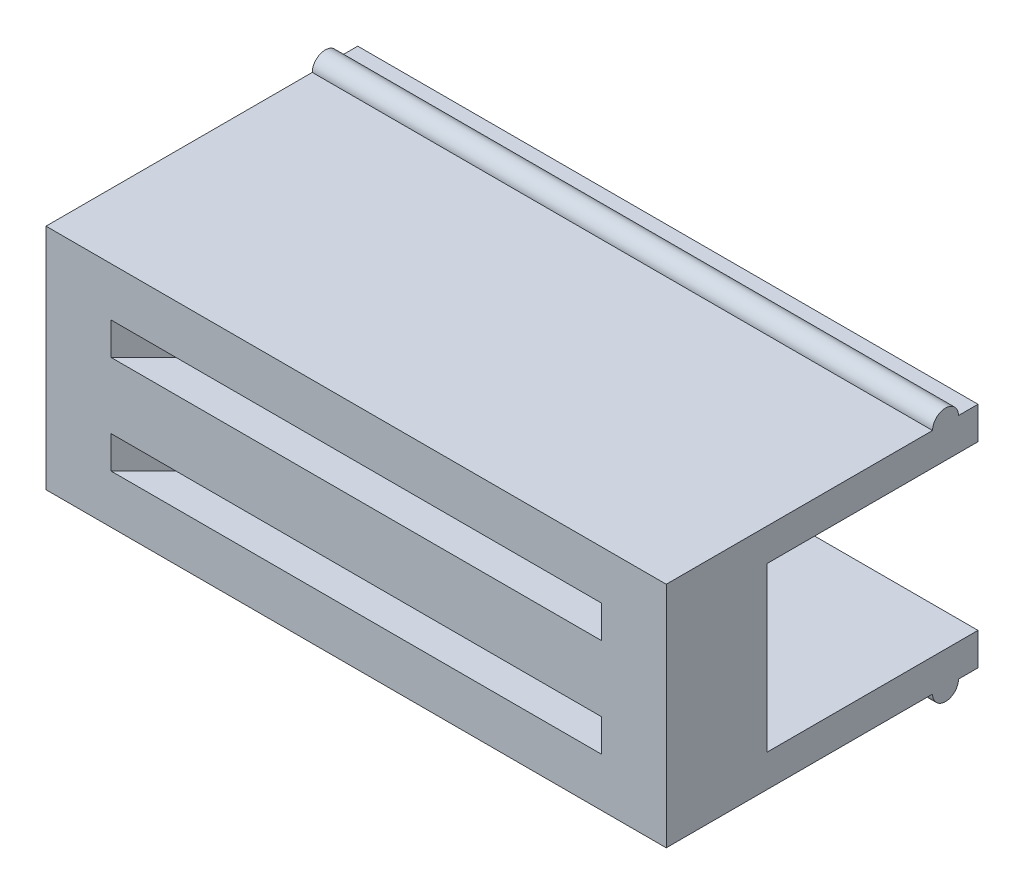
ISO-10303-21;
HEADER;
FILE_DESCRIPTION(('STEP AP214'),'2;1');
FILE_NAME('part.step','',(''),(''),'','','');
FILE_SCHEMA(('AUTOMOTIVE_DESIGN { 1 0 10303 214 1 1 1 1 }'));
ENDSEC;
DATA;
#1=APPLICATION_CONTEXT('core data for automotive mechanical design processes');
#2=APPLICATION_PROTOCOL_DEFINITION('international standard','automotive_design',2000,#1);
#3=PRODUCT_CONTEXT('',#1,'mechanical');
#4=PRODUCT('Part','Part','',(#3));
#5=PRODUCT_RELATED_PRODUCT_CATEGORY('part','',(#4));
#6=PRODUCT_DEFINITION_FORMATION('','',#4);
#7=PRODUCT_DEFINITION_CONTEXT('part definition',#1,'design');
#8=PRODUCT_DEFINITION('design','',#6,#7);
#9=PRODUCT_DEFINITION_SHAPE('','',#8);
#10=(LENGTH_UNIT() NAMED_UNIT(*) SI_UNIT(.MILLI.,.METRE.));
#11=(NAMED_UNIT(*) PLANE_ANGLE_UNIT() SI_UNIT($,.RADIAN.));
#12=(NAMED_UNIT(*) SI_UNIT($,.STERADIAN.) SOLID_ANGLE_UNIT());
#13=UNCERTAINTY_MEASURE_WITH_UNIT(LENGTH_MEASURE(1.E-05),#10,'distance_accuracy_value','');
#14=(GEOMETRIC_REPRESENTATION_CONTEXT(3) GLOBAL_UNCERTAINTY_ASSIGNED_CONTEXT((#13)) GLOBAL_UNIT_ASSIGNED_CONTEXT((#10,
#11,#12)) REPRESENTATION_CONTEXT('',''));
#15=CARTESIAN_POINT('',(0.,0.,0.));
#16=DIRECTION('',(0.,0.,1.));
#17=DIRECTION('',(1.,0.,0.));
#18=AXIS2_PLACEMENT_3D('',#15,#16,#17);
#19=CARTESIAN_POINT('',(-9.55,3.51500000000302,9.6));
#20=DIRECTION('',(0.,-1.,0.));
#21=DIRECTION('',(0.,0.,-1.));
#22=AXIS2_PLACEMENT_3D('',#19,#20,#21);
#23=PLANE('',#22);
#24=DIRECTION('',(0.,0.,-1.));
#25=VECTOR('',#24,1.);
#26=CARTESIAN_POINT('',(-9.55,3.51500000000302,9.6));
#27=LINE('',#26,#25);
#28=CARTESIAN_POINT('',(-9.55,3.51500000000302,0.599999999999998));
#29=VERTEX_POINT('',#28);
#30=CARTESIAN_POINT('',(-9.55,3.51500000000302,0.));
#31=VERTEX_POINT('',#30);
#32=EDGE_CURVE('E352',#29,#31,#27,.T.);
#33=ORIENTED_EDGE('',*,*,#32,.F.);
#34=DIRECTION('',(1.,0.,0.));
#35=VECTOR('',#34,1.);
#36=CARTESIAN_POINT('',(-9.55,3.51500000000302,0.599999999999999));
#37=LINE('',#36,#35);
#38=CARTESIAN_POINT('',(9.55,3.51500000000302,0.599999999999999));
#39=VERTEX_POINT('',#38);
#40=EDGE_CURVE('E231',#29,#39,#37,.T.);
#41=ORIENTED_EDGE('',*,*,#40,.T.);
#42=DIRECTION('',(0.,0.,-1.));
#43=VECTOR('',#42,1.);
#44=CARTESIAN_POINT('',(9.55,3.51500000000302,9.6));
#45=LINE('',#44,#43);
#46=CARTESIAN_POINT('',(9.55,3.51500000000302,0.));
#47=VERTEX_POINT('',#46);
#48=EDGE_CURVE('E373',#39,#47,#45,.T.);
#49=ORIENTED_EDGE('',*,*,#48,.T.);
#50=DIRECTION('',(-1.,0.,0.));
#51=VECTOR('',#50,1.);
#52=CARTESIAN_POINT('',(-9.55,3.51500000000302,0.));
#53=LINE('',#52,#51);
#54=EDGE_CURVE('E343',#47,#31,#53,.T.);
#55=ORIENTED_EDGE('',*,*,#54,.T.);
#56=EDGE_LOOP('',(#33,#41,#49,#55));
#57=FACE_BOUND('',#56,.T.);
#58=ADVANCED_FACE('F45',(#57),#23,.F.);
#59=CARTESIAN_POINT('',(-9.55,-3.51500000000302,9.6));
#60=DIRECTION('',(0.,1.,0.));
#61=DIRECTION('',(0.,0.,1.));
#62=AXIS2_PLACEMENT_3D('',#59,#60,#61);
#63=PLANE('',#62);
#64=DIRECTION('',(0.,0.,-1.));
#65=VECTOR('',#64,1.);
#66=CARTESIAN_POINT('',(-9.55,-3.51500000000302,9.6));
#67=LINE('',#66,#65);
#68=CARTESIAN_POINT('',(-9.55,-3.51500000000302,9.6));
#69=VERTEX_POINT('',#68);
#70=CARTESIAN_POINT('',(-9.55,-3.51500000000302,1.4));
#71=VERTEX_POINT('',#70);
#72=EDGE_CURVE('E383',#69,#71,#67,.T.);
#73=ORIENTED_EDGE('',*,*,#72,.T.);
#74=DIRECTION('',(1.,0.,0.));
#75=VECTOR('',#74,1.);
#76=CARTESIAN_POINT('',(-9.55,-3.51500000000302,1.4));
#77=LINE('',#76,#75);
#78=CARTESIAN_POINT('',(9.55,-3.51500000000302,1.4));
#79=VERTEX_POINT('',#78);
#80=EDGE_CURVE('E298',#71,#79,#77,.T.);
#81=ORIENTED_EDGE('',*,*,#80,.T.);
#82=DIRECTION('',(0.,0.,-1.));
#83=VECTOR('',#82,1.);
#84=CARTESIAN_POINT('',(9.55,-3.51500000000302,9.6));
#85=LINE('',#84,#83);
#86=CARTESIAN_POINT('',(9.55,-3.51500000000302,9.6));
#87=VERTEX_POINT('',#86);
#88=EDGE_CURVE('E378',#87,#79,#85,.T.);
#89=ORIENTED_EDGE('',*,*,#88,.F.);
#90=DIRECTION('',(1.,0.,0.));
#91=VECTOR('',#90,1.);
#92=CARTESIAN_POINT('',(-9.55,-3.51500000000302,9.6));
#93=LINE('',#92,#91);
#94=EDGE_CURVE('E342',#69,#87,#93,.T.);
#95=ORIENTED_EDGE('',*,*,#94,.F.);
#96=EDGE_LOOP('',(#73,#81,#89,#95));
#97=FACE_BOUND('',#96,.T.);
#98=ADVANCED_FACE('F435',(#97),#63,.F.);
#99=CARTESIAN_POINT('',(0.,0.,0.));
#100=DIRECTION('',(0.,0.,1.));
#101=DIRECTION('',(1.,0.,0.));
#102=AXIS2_PLACEMENT_3D('',#99,#100,#101);
#103=PLANE('',#102);
#104=DIRECTION('',(0.,-1.,0.));
#105=VECTOR('',#104,1.);
#106=CARTESIAN_POINT('',(-9.55,3.51500000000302,0.));
#107=LINE('',#106,#105);
#108=CARTESIAN_POINT('',(-9.55,-2.51500000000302,0.));
#109=VERTEX_POINT('',#108);
#110=CARTESIAN_POINT('',(-9.55,-3.51500000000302,0.));
#111=VERTEX_POINT('',#110);
#112=EDGE_CURVE('E328',#109,#111,#107,.T.);
#113=ORIENTED_EDGE('',*,*,#112,.F.);
#114=DIRECTION('',(-1.,0.,0.));
#115=VECTOR('',#114,1.);
#116=CARTESIAN_POINT('',(-9.55,-2.51500000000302,0.));
#117=LINE('',#116,#115);
#118=CARTESIAN_POINT('',(9.55,-2.51500000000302,0.));
#119=VERTEX_POINT('',#118);
#120=EDGE_CURVE('E308',#119,#109,#117,.T.);
#121=ORIENTED_EDGE('',*,*,#120,.F.);
#122=DIRECTION('',(0.,1.,0.));
#123=VECTOR('',#122,1.);
#124=CARTESIAN_POINT('',(9.55,3.51500000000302,0.));
#125=LINE('',#124,#123);
#126=CARTESIAN_POINT('',(9.55,-3.51500000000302,0.));
#127=VERTEX_POINT('',#126);
#128=EDGE_CURVE('E362',#127,#119,#125,.T.);
#129=ORIENTED_EDGE('',*,*,#128,.F.);
#130=DIRECTION('',(1.,0.,0.));
#131=VECTOR('',#130,1.);
#132=CARTESIAN_POINT('',(-9.55,-3.51500000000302,0.));
#133=LINE('',#132,#131);
#134=EDGE_CURVE('E357',#111,#127,#133,.T.);
#135=ORIENTED_EDGE('',*,*,#134,.F.);
#136=EDGE_LOOP('',(#113,#121,#129,#135));
#137=FACE_BOUND('',#136,.T.);
#138=ADVANCED_FACE('F440',(#137),#103,.F.);
#139=CARTESIAN_POINT('',(-9.55,3.51500000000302,9.6));
#140=DIRECTION('',(1.,0.,0.));
#141=DIRECTION('',(0.,0.,-1.));
#142=AXIS2_PLACEMENT_3D('',#139,#140,#141);
#143=PLANE('',#142);
#144=CARTESIAN_POINT('',(-9.55,3.51500000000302,9.6));
#145=VERTEX_POINT('',#144);
#146=CARTESIAN_POINT('',(-9.55,3.51500000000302,1.4));
#147=VERTEX_POINT('',#146);
#148=EDGE_CURVE('E369',#145,#147,#27,.T.);
#149=ORIENTED_EDGE('',*,*,#148,.T.);
#150=CARTESIAN_POINT('',(-9.55,3.51500000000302,0.999999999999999));
#151=DIRECTION('',(1.,0.,0.));
#152=DIRECTION('',(0.,0.,-1.));
#153=AXIS2_PLACEMENT_3D('',#150,#151,#152);
#154=CIRCLE('',#153,0.4);
#155=EDGE_CURVE('E285',#29,#147,#154,.T.);
#156=ORIENTED_EDGE('',*,*,#155,.F.);
#157=ORIENTED_EDGE('',*,*,#32,.T.);
#158=CARTESIAN_POINT('',(-9.55,2.51500000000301,0.));
#159=VERTEX_POINT('',#158);
#160=EDGE_CURVE('E353',#31,#159,#107,.T.);
#161=ORIENTED_EDGE('',*,*,#160,.T.);
#162=DIRECTION('',(0.,0.,-1.));
#163=VECTOR('',#162,1.);
#164=CARTESIAN_POINT('',(-9.55,2.51500000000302,6.5));
#165=LINE('',#164,#163);
#166=CARTESIAN_POINT('',(-9.55,2.51500000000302,6.5));
#167=VERTEX_POINT('',#166);
#168=EDGE_CURVE('E319',#167,#159,#165,.T.);
#169=ORIENTED_EDGE('',*,*,#168,.F.);
#170=DIRECTION('',(0.,1.,0.));
#171=VECTOR('',#170,1.);
#172=CARTESIAN_POINT('',(-9.55,-2.51500000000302,6.5));
#173=LINE('',#172,#171);
#174=CARTESIAN_POINT('',(-9.55,-2.51500000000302,6.5));
#175=VERTEX_POINT('',#174);
#176=EDGE_CURVE('E303',#175,#167,#173,.T.);
#177=ORIENTED_EDGE('',*,*,#176,.F.);
#178=DIRECTION('',(0.,0.,-1.));
#179=VECTOR('',#178,1.);
#180=CARTESIAN_POINT('',(-9.55,-2.51500000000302,6.5));
#181=LINE('',#180,#179);
#182=EDGE_CURVE('E324',#175,#109,#181,.T.);
#183=ORIENTED_EDGE('',*,*,#182,.T.);
#184=ORIENTED_EDGE('',*,*,#112,.T.);
#185=CARTESIAN_POINT('',(-9.55,-3.51500000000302,0.599999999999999));
#186=VERTEX_POINT('',#185);
#187=EDGE_CURVE('E382',#186,#111,#67,.T.);
#188=ORIENTED_EDGE('',*,*,#187,.F.);
#189=CARTESIAN_POINT('',(-9.55,-3.51500000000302,0.999999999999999));
#190=DIRECTION('',(1.,0.,0.));
#191=DIRECTION('',(0.,0.,-1.));
#192=AXIS2_PLACEMENT_3D('',#189,#190,#191);
#193=CIRCLE('',#192,0.4);
#194=EDGE_CURVE('E289',#71,#186,#193,.T.);
#195=ORIENTED_EDGE('',*,*,#194,.F.);
#196=ORIENTED_EDGE('',*,*,#72,.F.);
#197=DIRECTION('',(0.,-1.,0.));
#198=VECTOR('',#197,1.);
#199=CARTESIAN_POINT('',(-9.55,3.51500000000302,9.6));
#200=LINE('',#199,#198);
#201=EDGE_CURVE('E338',#145,#69,#200,.T.);
#202=ORIENTED_EDGE('',*,*,#201,.F.);
#203=EDGE_LOOP('',(#149,#156,#157,#161,#169,#177,#183,#184,#188,#195,#196,#202));
#204=FACE_BOUND('',#203,.T.);
#205=ADVANCED_FACE('F398',(#204),#143,.F.);
#206=CARTESIAN_POINT('',(9.55,-3.51500000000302,0.599999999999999));
#207=VERTEX_POINT('',#206);
#208=EDGE_CURVE('E377',#207,#127,#85,.T.);
#209=ORIENTED_EDGE('',*,*,#208,.F.);
#210=DIRECTION('',(1.,0.,0.));
#211=VECTOR('',#210,1.);
#212=CARTESIAN_POINT('',(-9.55,-3.51500000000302,0.599999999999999));
#213=LINE('',#212,#211);
#214=EDGE_CURVE('E292',#207,#186,#213,.F.);
#215=ORIENTED_EDGE('',*,*,#214,.T.);
#216=ORIENTED_EDGE('',*,*,#187,.T.);
#217=ORIENTED_EDGE('',*,*,#134,.T.);
#218=EDGE_LOOP('',(#209,#215,#216,#217));
#219=FACE_BOUND('',#218,.T.);
#220=ADVANCED_FACE('F443',(#219),#63,.F.);
#221=CARTESIAN_POINT('',(9.55,3.51500000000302,9.6));
#222=DIRECTION('',(-1.,0.,0.));
#223=DIRECTION('',(0.,0.,1.));
#224=AXIS2_PLACEMENT_3D('',#221,#222,#223);
#225=PLANE('',#224);
#226=ORIENTED_EDGE('',*,*,#48,.F.);
#227=CARTESIAN_POINT('',(9.55,3.51500000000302,0.999999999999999));
#228=DIRECTION('',(1.,0.,0.));
#229=DIRECTION('',(0.,0.,-1.));
#230=AXIS2_PLACEMENT_3D('',#227,#228,#229);
#231=CIRCLE('',#230,0.4);
#232=CARTESIAN_POINT('',(9.55,3.51500000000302,1.4));
#233=VERTEX_POINT('',#232);
#234=EDGE_CURVE('E280',#39,#233,#231,.T.);
#235=ORIENTED_EDGE('',*,*,#234,.T.);
#236=CARTESIAN_POINT('',(9.55,3.51500000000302,9.6));
#237=VERTEX_POINT('',#236);
#238=EDGE_CURVE('E374',#237,#233,#45,.T.);
#239=ORIENTED_EDGE('',*,*,#238,.F.);
#240=DIRECTION('',(0.,1.,0.));
#241=VECTOR('',#240,1.);
#242=CARTESIAN_POINT('',(9.55,3.51500000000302,9.6));
#243=LINE('',#242,#241);
#244=EDGE_CURVE('E346',#87,#237,#243,.T.);
#245=ORIENTED_EDGE('',*,*,#244,.F.);
#246=ORIENTED_EDGE('',*,*,#88,.T.);
#247=CARTESIAN_POINT('',(9.55,-3.51500000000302,0.999999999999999));
#248=DIRECTION('',(1.,0.,0.));
#249=DIRECTION('',(0.,0.,-1.));
#250=AXIS2_PLACEMENT_3D('',#247,#248,#249);
#251=CIRCLE('',#250,0.4);
#252=EDGE_CURVE('E284',#79,#207,#251,.T.);
#253=ORIENTED_EDGE('',*,*,#252,.T.);
#254=ORIENTED_EDGE('',*,*,#208,.T.);
#255=ORIENTED_EDGE('',*,*,#128,.T.);
#256=DIRECTION('',(0.,0.,-1.));
#257=VECTOR('',#256,1.);
#258=CARTESIAN_POINT('',(9.55,-2.51500000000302,6.5));
#259=LINE('',#258,#257);
#260=CARTESIAN_POINT('',(9.55,-2.51500000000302,6.5));
#261=VERTEX_POINT('',#260);
#262=EDGE_CURVE('E329',#261,#119,#259,.T.);
#263=ORIENTED_EDGE('',*,*,#262,.F.);
#264=DIRECTION('',(0.,-1.,0.));
#265=VECTOR('',#264,1.);
#266=CARTESIAN_POINT('',(9.55,-2.51500000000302,6.5));
#267=LINE('',#266,#265);
#268=CARTESIAN_POINT('',(9.55,2.51500000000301,6.5));
#269=VERTEX_POINT('',#268);
#270=EDGE_CURVE('E312',#269,#261,#267,.T.);
#271=ORIENTED_EDGE('',*,*,#270,.F.);
#272=DIRECTION('',(0.,0.,-1.));
#273=VECTOR('',#272,1.);
#274=CARTESIAN_POINT('',(9.55,2.51500000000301,6.5));
#275=LINE('',#274,#273);
#276=CARTESIAN_POINT('',(9.55,2.51500000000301,0.));
#277=VERTEX_POINT('',#276);
#278=EDGE_CURVE('E332',#269,#277,#275,.T.);
#279=ORIENTED_EDGE('',*,*,#278,.T.);
#280=EDGE_CURVE('E361',#277,#47,#125,.T.);
#281=ORIENTED_EDGE('',*,*,#280,.T.);
#282=EDGE_LOOP('',(#226,#235,#239,#245,#246,#253,#254,#255,#263,#271,#279,#281));
#283=FACE_BOUND('',#282,.T.);
#284=ADVANCED_FACE('F447',(#283),#225,.F.);
#285=ORIENTED_EDGE('',*,*,#238,.T.);
#286=DIRECTION('',(1.,0.,0.));
#287=VECTOR('',#286,1.);
#288=CARTESIAN_POINT('',(-9.55,3.51500000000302,1.4));
#289=LINE('',#288,#287);
#290=EDGE_CURVE('E238',#233,#147,#289,.F.);
#291=ORIENTED_EDGE('',*,*,#290,.T.);
#292=ORIENTED_EDGE('',*,*,#148,.F.);
#293=DIRECTION('',(-1.,0.,0.));
#294=VECTOR('',#293,1.);
#295=CARTESIAN_POINT('',(-9.55,3.51500000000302,9.6));
#296=LINE('',#295,#294);
#297=EDGE_CURVE('E349',#237,#145,#296,.T.);
#298=ORIENTED_EDGE('',*,*,#297,.F.);
#299=EDGE_LOOP('',(#285,#291,#292,#298));
#300=FACE_BOUND('',#299,.T.);
#301=ADVANCED_FACE('F390',(#300),#23,.F.);
#302=CARTESIAN_POINT('',(0.,0.,9.6));
#303=DIRECTION('',(0.,0.,1.));
#304=DIRECTION('',(1.,0.,0.));
#305=AXIS2_PLACEMENT_3D('',#302,#303,#304);
#306=PLANE('',#305);
#307=DIRECTION('',(0.,1.,0.));
#308=VECTOR('',#307,1.);
#309=CARTESIAN_POINT('',(7.55,-2.01500000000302,9.6));
#310=LINE('',#309,#308);
#311=CARTESIAN_POINT('',(7.55,-2.01500000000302,9.6));
#312=VERTEX_POINT('',#311);
#313=CARTESIAN_POINT('',(7.55,-1.01500000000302,9.6));
#314=VERTEX_POINT('',#313);
#315=EDGE_CURVE('E192',#312,#314,#310,.T.);
#316=ORIENTED_EDGE('',*,*,#315,.F.);
#317=DIRECTION('',(1.,0.,0.));
#318=VECTOR('',#317,1.);
#319=CARTESIAN_POINT('',(7.55,-2.01500000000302,9.6));
#320=LINE('',#319,#318);
#321=CARTESIAN_POINT('',(-7.55,-2.01500000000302,9.6));
#322=VERTEX_POINT('',#321);
#323=EDGE_CURVE('E198',#322,#312,#320,.T.);
#324=ORIENTED_EDGE('',*,*,#323,.F.);
#325=DIRECTION('',(0.,-1.,0.));
#326=VECTOR('',#325,1.);
#327=CARTESIAN_POINT('',(-7.55,-2.01500000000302,9.6));
#328=LINE('',#327,#326);
#329=CARTESIAN_POINT('',(-7.55,-1.01500000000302,9.6));
#330=VERTEX_POINT('',#329);
#331=EDGE_CURVE('E191',#330,#322,#328,.T.);
#332=ORIENTED_EDGE('',*,*,#331,.F.);
#333=DIRECTION('',(-1.,0.,0.));
#334=VECTOR('',#333,1.);
#335=CARTESIAN_POINT('',(7.55,-1.01500000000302,9.6));
#336=LINE('',#335,#334);
#337=EDGE_CURVE('E182',#314,#330,#336,.T.);
#338=ORIENTED_EDGE('',*,*,#337,.F.);
#339=EDGE_LOOP('',(#316,#324,#332,#338));
#340=FACE_BOUND('',#339,.T.);
#341=DIRECTION('',(0.,-1.,0.));
#342=VECTOR('',#341,1.);
#343=CARTESIAN_POINT('',(-7.55,2.01500000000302,9.6));
#344=LINE('',#343,#342);
#345=CARTESIAN_POINT('',(-7.55,2.01500000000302,9.6));
#346=VERTEX_POINT('',#345);
#347=CARTESIAN_POINT('',(-7.55,1.01500000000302,9.6));
#348=VERTEX_POINT('',#347);
#349=EDGE_CURVE('E265',#346,#348,#344,.T.);
#350=ORIENTED_EDGE('',*,*,#349,.F.);
#351=DIRECTION('',(-1.,0.,0.));
#352=VECTOR('',#351,1.);
#353=CARTESIAN_POINT('',(-7.55,2.01500000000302,9.6));
#354=LINE('',#353,#352);
#355=CARTESIAN_POINT('',(7.55,2.01500000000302,9.6));
#356=VERTEX_POINT('',#355);
#357=EDGE_CURVE('E279',#356,#346,#354,.T.);
#358=ORIENTED_EDGE('',*,*,#357,.F.);
#359=DIRECTION('',(0.,1.,0.));
#360=VECTOR('',#359,1.);
#361=CARTESIAN_POINT('',(7.55,2.01500000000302,9.6));
#362=LINE('',#361,#360);
#363=CARTESIAN_POINT('',(7.55,1.01500000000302,9.6));
#364=VERTEX_POINT('',#363);
#365=EDGE_CURVE('E273',#364,#356,#362,.T.);
#366=ORIENTED_EDGE('',*,*,#365,.F.);
#367=DIRECTION('',(1.,0.,0.));
#368=VECTOR('',#367,1.);
#369=CARTESIAN_POINT('',(-7.55,1.01500000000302,9.6));
#370=LINE('',#369,#368);
#371=EDGE_CURVE('E268',#348,#364,#370,.T.);
#372=ORIENTED_EDGE('',*,*,#371,.F.);
#373=EDGE_LOOP('',(#350,#358,#366,#372));
#374=FACE_BOUND('',#373,.T.);
#375=ORIENTED_EDGE('',*,*,#201,.T.);
#376=ORIENTED_EDGE('',*,*,#94,.T.);
#377=ORIENTED_EDGE('',*,*,#244,.T.);
#378=ORIENTED_EDGE('',*,*,#297,.T.);
#379=EDGE_LOOP('',(#375,#376,#377,#378));
#380=FACE_BOUND('',#379,.T.);
#381=ADVANCED_FACE('F196',(#340,#374,#380),#306,.T.);
#382=ORIENTED_EDGE('',*,*,#280,.F.);
#383=DIRECTION('',(1.,0.,0.));
#384=VECTOR('',#383,1.);
#385=CARTESIAN_POINT('',(-9.55,2.51500000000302,0.));
#386=LINE('',#385,#384);
#387=EDGE_CURVE('E302',#159,#277,#386,.T.);
#388=ORIENTED_EDGE('',*,*,#387,.F.);
#389=ORIENTED_EDGE('',*,*,#160,.F.);
#390=ORIENTED_EDGE('',*,*,#54,.F.);
#391=EDGE_LOOP('',(#382,#388,#389,#390));
#392=FACE_BOUND('',#391,.T.);
#393=ADVANCED_FACE('F452',(#392),#103,.F.);
#394=CARTESIAN_POINT('',(-9.55,-2.51500000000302,6.5));
#395=DIRECTION('',(0.,-1.,0.));
#396=DIRECTION('',(1.,0.,0.));
#397=AXIS2_PLACEMENT_3D('',#394,#395,#396);
#398=PLANE('',#397);
#399=ORIENTED_EDGE('',*,*,#120,.T.);
#400=ORIENTED_EDGE('',*,*,#182,.F.);
#401=DIRECTION('',(-1.,0.,0.));
#402=VECTOR('',#401,1.);
#403=CARTESIAN_POINT('',(-9.55,-2.51500000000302,6.5));
#404=LINE('',#403,#402);
#405=EDGE_CURVE('E315',#261,#175,#404,.T.);
#406=ORIENTED_EDGE('',*,*,#405,.F.);
#407=ORIENTED_EDGE('',*,*,#262,.T.);
#408=EDGE_LOOP('',(#399,#400,#406,#407));
#409=FACE_BOUND('',#408,.T.);
#410=ADVANCED_FACE('F583',(#409),#398,.F.);
#411=CARTESIAN_POINT('',(-9.55,2.51500000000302,6.5));
#412=DIRECTION('',(0.,1.,0.));
#413=DIRECTION('',(-1.,0.,0.));
#414=AXIS2_PLACEMENT_3D('',#411,#412,#413);
#415=PLANE('',#414);
#416=ORIENTED_EDGE('',*,*,#387,.T.);
#417=ORIENTED_EDGE('',*,*,#278,.F.);
#418=DIRECTION('',(1.,0.,0.));
#419=VECTOR('',#418,1.);
#420=CARTESIAN_POINT('',(-9.55,2.51500000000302,6.5));
#421=LINE('',#420,#419);
#422=EDGE_CURVE('E307',#167,#269,#421,.T.);
#423=ORIENTED_EDGE('',*,*,#422,.F.);
#424=ORIENTED_EDGE('',*,*,#168,.T.);
#425=EDGE_LOOP('',(#416,#417,#423,#424));
#426=FACE_BOUND('',#425,.T.);
#427=ADVANCED_FACE('F574',(#426),#415,.F.);
#428=CARTESIAN_POINT('',(0.,0.,6.5));
#429=DIRECTION('',(0.,0.,-1.));
#430=DIRECTION('',(-1.,0.,0.));
#431=AXIS2_PLACEMENT_3D('',#428,#429,#430);
#432=PLANE('',#431);
#433=ORIENTED_EDGE('',*,*,#176,.T.);
#434=ORIENTED_EDGE('',*,*,#422,.T.);
#435=ORIENTED_EDGE('',*,*,#270,.T.);
#436=ORIENTED_EDGE('',*,*,#405,.T.);
#437=EDGE_LOOP('',(#433,#434,#435,#436));
#438=FACE_BOUND('',#437,.T.);
#439=ADVANCED_FACE('F547',(#438),#432,.T.);
#440=CARTESIAN_POINT('',(-9.55,-3.51500000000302,0.999999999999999));
#441=DIRECTION('',(1.,0.,0.));
#442=DIRECTION('',(0.,0.,-1.));
#443=AXIS2_PLACEMENT_3D('',#440,#441,#442);
#444=CYLINDRICAL_SURFACE('',#443,0.4);
#445=ORIENTED_EDGE('',*,*,#80,.F.);
#446=ORIENTED_EDGE('',*,*,#194,.T.);
#447=ORIENTED_EDGE('',*,*,#214,.F.);
#448=ORIENTED_EDGE('',*,*,#252,.F.);
#449=EDGE_LOOP('',(#445,#446,#447,#448));
#450=FACE_BOUND('',#449,.T.);
#451=ADVANCED_FACE('F432',(#450),#444,.T.);
#452=CARTESIAN_POINT('',(-9.55,3.51500000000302,0.999999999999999));
#453=DIRECTION('',(1.,0.,0.));
#454=DIRECTION('',(0.,0.,-1.));
#455=AXIS2_PLACEMENT_3D('',#452,#453,#454);
#456=CYLINDRICAL_SURFACE('',#455,0.4);
#457=ORIENTED_EDGE('',*,*,#40,.F.);
#458=ORIENTED_EDGE('',*,*,#155,.T.);
#459=ORIENTED_EDGE('',*,*,#290,.F.);
#460=ORIENTED_EDGE('',*,*,#234,.F.);
#461=EDGE_LOOP('',(#457,#458,#459,#460));
#462=FACE_BOUND('',#461,.T.);
#463=ADVANCED_FACE('F401',(#462),#456,.T.);
#464=CARTESIAN_POINT('',(-7.55,2.01500000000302,7.6));
#465=DIRECTION('',(0.,1.,0.));
#466=DIRECTION('',(0.,0.,1.));
#467=AXIS2_PLACEMENT_3D('',#464,#465,#466);
#468=PLANE('',#467);
#469=DIRECTION('',(-1.,0.,0.));
#470=VECTOR('',#469,1.);
#471=CARTESIAN_POINT('',(-7.55,2.01500000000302,7.6));
#472=LINE('',#471,#470);
#473=CARTESIAN_POINT('',(5.54999999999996,2.01500000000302,7.6));
#474=VERTEX_POINT('',#473);
#475=CARTESIAN_POINT('',(-5.54999999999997,2.01500000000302,7.6));
#476=VERTEX_POINT('',#475);
#477=EDGE_CURVE('E228',#474,#476,#472,.T.);
#478=ORIENTED_EDGE('',*,*,#477,.F.);
#479=DIRECTION('',(0.707106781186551,0.,0.707106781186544));
#480=VECTOR('',#479,1.);
#481=CARTESIAN_POINT('',(5.54999999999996,2.01500000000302,7.6));
#482=LINE('',#481,#480);
#483=EDGE_CURVE('E244',#474,#356,#482,.T.);
#484=ORIENTED_EDGE('',*,*,#483,.T.);
#485=ORIENTED_EDGE('',*,*,#357,.T.);
#486=DIRECTION('',(0.707106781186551,0.,-0.707106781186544));
#487=VECTOR('',#486,1.);
#488=CARTESIAN_POINT('',(-5.54999999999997,2.01500000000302,7.6));
#489=LINE('',#488,#487);
#490=EDGE_CURVE('E235',#346,#476,#489,.T.);
#491=ORIENTED_EDGE('',*,*,#490,.T.);
#492=EDGE_LOOP('',(#478,#484,#485,#491));
#493=FACE_BOUND('',#492,.T.);
#494=ADVANCED_FACE('F424',(#493),#468,.F.);
#495=CARTESIAN_POINT('',(-7.55,1.01500000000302,7.6));
#496=DIRECTION('',(0.,-1.,0.));
#497=DIRECTION('',(0.,0.,-1.));
#498=AXIS2_PLACEMENT_3D('',#495,#496,#497);
#499=PLANE('',#498);
#500=ORIENTED_EDGE('',*,*,#371,.T.);
#501=DIRECTION('',(-0.707106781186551,0.,-0.707106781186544));
#502=VECTOR('',#501,1.);
#503=CARTESIAN_POINT('',(5.54999999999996,1.01500000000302,7.6));
#504=LINE('',#503,#502);
#505=CARTESIAN_POINT('',(6.54999999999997,1.01500000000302,8.6));
#506=VERTEX_POINT('',#505);
#507=EDGE_CURVE('E250',#364,#506,#504,.T.);
#508=ORIENTED_EDGE('',*,*,#507,.T.);
#509=DIRECTION('',(-1.,0.,0.));
#510=VECTOR('',#509,1.);
#511=CARTESIAN_POINT('',(-7.55,1.01500000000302,8.6));
#512=LINE('',#511,#510);
#513=CARTESIAN_POINT('',(-6.54999999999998,1.01500000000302,8.6));
#514=VERTEX_POINT('',#513);
#515=EDGE_CURVE('E255',#506,#514,#512,.T.);
#516=ORIENTED_EDGE('',*,*,#515,.T.);
#517=DIRECTION('',(-0.707106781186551,0.,0.707106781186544));
#518=VECTOR('',#517,1.);
#519=CARTESIAN_POINT('',(-5.54999999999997,1.01500000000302,7.6));
#520=LINE('',#519,#518);
#521=EDGE_CURVE('E247',#514,#348,#520,.T.);
#522=ORIENTED_EDGE('',*,*,#521,.T.);
#523=EDGE_LOOP('',(#500,#508,#516,#522));
#524=FACE_BOUND('',#523,.T.);
#525=ADVANCED_FACE('F258',(#524),#499,.F.);
#526=CARTESIAN_POINT('',(7.55,-2.01500000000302,7.6));
#527=DIRECTION('',(0.,-1.,0.));
#528=DIRECTION('',(1.,0.,0.));
#529=AXIS2_PLACEMENT_3D('',#526,#527,#528);
#530=PLANE('',#529);
#531=ORIENTED_EDGE('',*,*,#323,.T.);
#532=DIRECTION('',(-0.707106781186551,0.,-0.707106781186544));
#533=VECTOR('',#532,1.);
#534=CARTESIAN_POINT('',(5.54999999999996,-2.01500000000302,7.6));
#535=LINE('',#534,#533);
#536=CARTESIAN_POINT('',(5.54999999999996,-2.01500000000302,7.6));
#537=VERTEX_POINT('',#536);
#538=EDGE_CURVE('E11',#312,#537,#535,.T.);
#539=ORIENTED_EDGE('',*,*,#538,.T.);
#540=DIRECTION('',(1.,0.,0.));
#541=VECTOR('',#540,1.);
#542=CARTESIAN_POINT('',(7.55,-2.01500000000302,7.6));
#543=LINE('',#542,#541);
#544=CARTESIAN_POINT('',(-5.54999999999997,-2.01500000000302,7.6));
#545=VERTEX_POINT('',#544);
#546=EDGE_CURVE('E217',#545,#537,#543,.T.);
#547=ORIENTED_EDGE('',*,*,#546,.F.);
#548=DIRECTION('',(-0.707106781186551,0.,0.707106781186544));
#549=VECTOR('',#548,1.);
#550=CARTESIAN_POINT('',(-5.54999999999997,-2.01500000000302,7.6));
#551=LINE('',#550,#549);
#552=EDGE_CURVE('E55',#545,#322,#551,.T.);
#553=ORIENTED_EDGE('',*,*,#552,.T.);
#554=EDGE_LOOP('',(#531,#539,#547,#553));
#555=FACE_BOUND('',#554,.T.);
#556=ADVANCED_FACE('F215',(#555),#530,.F.);
#557=CARTESIAN_POINT('',(7.55,-1.01500000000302,7.6));
#558=DIRECTION('',(0.,1.,0.));
#559=DIRECTION('',(-1.,0.,0.));
#560=AXIS2_PLACEMENT_3D('',#557,#558,#559);
#561=PLANE('',#560);
#562=DIRECTION('',(-1.,0.,0.));
#563=VECTOR('',#562,1.);
#564=CARTESIAN_POINT('',(-7.55,-1.01500000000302,8.6));
#565=LINE('',#564,#563);
#566=CARTESIAN_POINT('',(6.54999999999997,-1.01500000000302,8.6));
#567=VERTEX_POINT('',#566);
#568=CARTESIAN_POINT('',(-6.54999999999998,-1.01500000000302,8.6));
#569=VERTEX_POINT('',#568);
#570=EDGE_CURVE('E256',#567,#569,#565,.T.);
#571=ORIENTED_EDGE('',*,*,#570,.F.);
#572=DIRECTION('',(0.707106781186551,0.,0.707106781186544));
#573=VECTOR('',#572,1.);
#574=CARTESIAN_POINT('',(5.54999999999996,-1.01500000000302,7.6));
#575=LINE('',#574,#573);
#576=EDGE_CURVE('E186',#567,#314,#575,.T.);
#577=ORIENTED_EDGE('',*,*,#576,.T.);
#578=ORIENTED_EDGE('',*,*,#337,.T.);
#579=DIRECTION('',(0.707106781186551,0.,-0.707106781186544));
#580=VECTOR('',#579,1.);
#581=CARTESIAN_POINT('',(-5.54999999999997,-1.01500000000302,7.6));
#582=LINE('',#581,#580);
#583=EDGE_CURVE('E62',#330,#569,#582,.T.);
#584=ORIENTED_EDGE('',*,*,#583,.T.);
#585=EDGE_LOOP('',(#571,#577,#578,#584));
#586=FACE_BOUND('',#585,.T.);
#587=ADVANCED_FACE('F184',(#586),#561,.F.);
#588=CARTESIAN_POINT('',(0.,0.,7.6));
#589=DIRECTION('',(0.,0.,1.));
#590=DIRECTION('',(1.,0.,0.));
#591=AXIS2_PLACEMENT_3D('',#588,#589,#590);
#592=PLANE('',#591);
#593=ORIENTED_EDGE('',*,*,#546,.T.);
#594=DIRECTION('',(0.,1.,0.));
#595=VECTOR('',#594,1.);
#596=CARTESIAN_POINT('',(5.54999999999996,0.,7.6));
#597=LINE('',#596,#595);
#598=EDGE_CURVE('E230',#537,#474,#597,.T.);
#599=ORIENTED_EDGE('',*,*,#598,.T.);
#600=ORIENTED_EDGE('',*,*,#477,.T.);
#601=DIRECTION('',(0.,-1.,0.));
#602=VECTOR('',#601,1.);
#603=CARTESIAN_POINT('',(-5.54999999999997,0.,7.6));
#604=LINE('',#603,#602);
#605=EDGE_CURVE('E221',#476,#545,#604,.T.);
#606=ORIENTED_EDGE('',*,*,#605,.T.);
#607=EDGE_LOOP('',(#593,#599,#600,#606));
#608=FACE_BOUND('',#607,.T.);
#609=ADVANCED_FACE('F224',(#608),#592,.T.);
#610=CARTESIAN_POINT('',(-7.55,1.18499999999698,8.6));
#611=DIRECTION('',(0.,0.,1.));
#612=DIRECTION('',(1.,0.,0.));
#613=AXIS2_PLACEMENT_3D('',#610,#611,#612);
#614=PLANE('',#613);
#615=ORIENTED_EDGE('',*,*,#515,.F.);
#616=DIRECTION('',(0.,-1.,0.));
#617=VECTOR('',#616,1.);
#618=CARTESIAN_POINT('',(6.54999999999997,0.,8.6));
#619=LINE('',#618,#617);
#620=EDGE_CURVE('E69',#506,#567,#619,.T.);
#621=ORIENTED_EDGE('',*,*,#620,.T.);
#622=ORIENTED_EDGE('',*,*,#570,.T.);
#623=DIRECTION('',(0.,1.,0.));
#624=VECTOR('',#623,1.);
#625=CARTESIAN_POINT('',(-6.54999999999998,0.,8.6));
#626=LINE('',#625,#624);
#627=EDGE_CURVE('E204',#569,#514,#626,.T.);
#628=ORIENTED_EDGE('',*,*,#627,.T.);
#629=EDGE_LOOP('',(#615,#621,#622,#628));
#630=FACE_BOUND('',#629,.T.);
#631=ADVANCED_FACE('F254',(#630),#614,.F.);
#632=CARTESIAN_POINT('',(5.54999999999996,0.,7.6));
#633=DIRECTION('',(0.707106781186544,0.,-0.707106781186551));
#634=DIRECTION('',(0.,1.,0.));
#635=AXIS2_PLACEMENT_3D('',#632,#633,#634);
#636=PLANE('',#635);
#637=ORIENTED_EDGE('',*,*,#507,.F.);
#638=ORIENTED_EDGE('',*,*,#365,.T.);
#639=ORIENTED_EDGE('',*,*,#483,.F.);
#640=ORIENTED_EDGE('',*,*,#598,.F.);
#641=ORIENTED_EDGE('',*,*,#538,.F.);
#642=ORIENTED_EDGE('',*,*,#315,.T.);
#643=ORIENTED_EDGE('',*,*,#576,.F.);
#644=ORIENTED_EDGE('',*,*,#620,.F.);
#645=EDGE_LOOP('',(#637,#638,#639,#640,#641,#642,#643,#644));
#646=FACE_BOUND('',#645,.T.);
#647=ADVANCED_FACE('F421',(#646),#636,.F.);
#648=CARTESIAN_POINT('',(-5.54999999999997,0.,7.6));
#649=DIRECTION('',(-0.707106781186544,0.,-0.707106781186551));
#650=DIRECTION('',(0.,-1.,0.));
#651=AXIS2_PLACEMENT_3D('',#648,#649,#650);
#652=PLANE('',#651);
#653=ORIENTED_EDGE('',*,*,#583,.F.);
#654=ORIENTED_EDGE('',*,*,#331,.T.);
#655=ORIENTED_EDGE('',*,*,#552,.F.);
#656=ORIENTED_EDGE('',*,*,#605,.F.);
#657=ORIENTED_EDGE('',*,*,#490,.F.);
#658=ORIENTED_EDGE('',*,*,#349,.T.);
#659=ORIENTED_EDGE('',*,*,#521,.F.);
#660=ORIENTED_EDGE('',*,*,#627,.F.);
#661=EDGE_LOOP('',(#653,#654,#655,#656,#657,#658,#659,#660));
#662=FACE_BOUND('',#661,.T.);
#663=ADVANCED_FACE('F48',(#662),#652,.F.);
#664=CLOSED_SHELL('',(#58,#98,#138,#205,#220,#284,#301,#381,#393,#410,#427,#439,#451,#463,#494,
#525,#556,#587,#609,#631,#647,#663));
#665=MANIFOLD_SOLID_BREP('B2',#664);
#666=ADVANCED_BREP_SHAPE_REPRESENTATION('',(#18,#665),#14);
#667=SHAPE_DEFINITION_REPRESENTATION(#9,#666);
ENDSEC;
END-ISO-10303-21;
